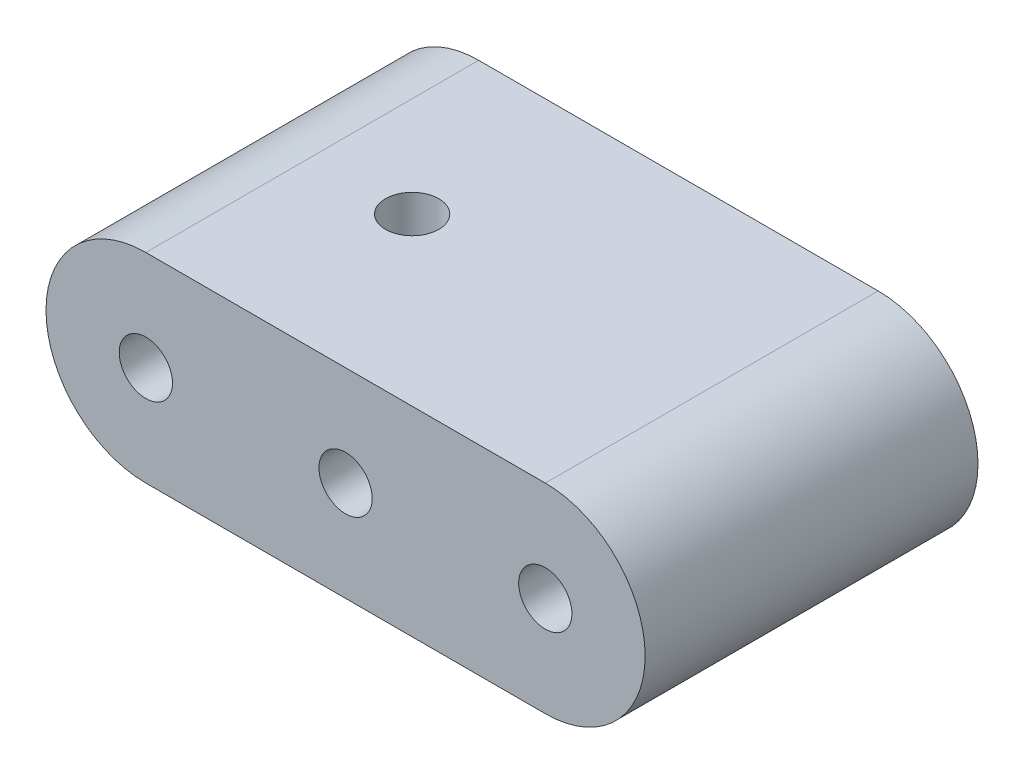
ISO-10303-21;
HEADER;
FILE_DESCRIPTION(('STEP AP214'),'2;1');
FILE_NAME('part.step','',(''),(''),'','','');
FILE_SCHEMA(('AUTOMOTIVE_DESIGN { 1 0 10303 214 1 1 1 1 }'));
ENDSEC;
DATA;
#1=APPLICATION_CONTEXT('core data for automotive mechanical design processes');
#2=APPLICATION_PROTOCOL_DEFINITION('international standard','automotive_design',2000,#1);
#3=PRODUCT_CONTEXT('',#1,'mechanical');
#4=PRODUCT('Part','Part','',(#3));
#5=PRODUCT_RELATED_PRODUCT_CATEGORY('part','',(#4));
#6=PRODUCT_DEFINITION_FORMATION('','',#4);
#7=PRODUCT_DEFINITION_CONTEXT('part definition',#1,'design');
#8=PRODUCT_DEFINITION('design','',#6,#7);
#9=PRODUCT_DEFINITION_SHAPE('','',#8);
#10=(LENGTH_UNIT() NAMED_UNIT(*) SI_UNIT(.MILLI.,.METRE.));
#11=(NAMED_UNIT(*) PLANE_ANGLE_UNIT() SI_UNIT($,.RADIAN.));
#12=(NAMED_UNIT(*) SI_UNIT($,.STERADIAN.) SOLID_ANGLE_UNIT());
#13=UNCERTAINTY_MEASURE_WITH_UNIT(LENGTH_MEASURE(1.E-05),#10,'distance_accuracy_value','');
#14=(GEOMETRIC_REPRESENTATION_CONTEXT(3) GLOBAL_UNCERTAINTY_ASSIGNED_CONTEXT((#13)) GLOBAL_UNIT_ASSIGNED_CONTEXT((#10,
#11,#12)) REPRESENTATION_CONTEXT('',''));
#15=CARTESIAN_POINT('',(0.,0.,0.));
#16=DIRECTION('',(0.,0.,1.));
#17=DIRECTION('',(1.,0.,0.));
#18=AXIS2_PLACEMENT_3D('',#15,#16,#17);
#19=CARTESIAN_POINT('',(-30.,0.,50.));
#20=DIRECTION('',(0.,0.,-1.));
#21=DIRECTION('',(-1.,0.,0.));
#22=AXIS2_PLACEMENT_3D('',#19,#20,#21);
#23=CYLINDRICAL_SURFACE('',#22,15.);
#24=CARTESIAN_POINT('',(-30.,0.,0.));
#25=DIRECTION('',(0.,0.,1.));
#26=DIRECTION('',(1.,0.,0.));
#27=AXIS2_PLACEMENT_3D('',#24,#25,#26);
#28=CIRCLE('',#27,15.);
#29=CARTESIAN_POINT('',(-30.,15.,0.));
#30=VERTEX_POINT('',#29);
#31=CARTESIAN_POINT('',(-30.,-15.,0.));
#32=VERTEX_POINT('',#31);
#33=EDGE_CURVE('E207',#30,#32,#28,.T.);
#34=ORIENTED_EDGE('',*,*,#33,.T.);
#35=DIRECTION('',(0.,0.,-1.));
#36=VECTOR('',#35,1.);
#37=CARTESIAN_POINT('',(-30.,-15.,50.));
#38=LINE('',#37,#36);
#39=CARTESIAN_POINT('',(-30.,-15.,50.));
#40=VERTEX_POINT('',#39);
#41=EDGE_CURVE('E11',#40,#32,#38,.T.);
#42=ORIENTED_EDGE('',*,*,#41,.F.);
#43=CARTESIAN_POINT('',(-30.,0.,50.));
#44=DIRECTION('',(0.,0.,1.));
#45=DIRECTION('',(1.,0.,0.));
#46=AXIS2_PLACEMENT_3D('',#43,#44,#45);
#47=CIRCLE('',#46,15.);
#48=CARTESIAN_POINT('',(-30.,15.,50.));
#49=VERTEX_POINT('',#48);
#50=EDGE_CURVE('E227',#49,#40,#47,.T.);
#51=ORIENTED_EDGE('',*,*,#50,.F.);
#52=DIRECTION('',(0.,0.,-1.));
#53=VECTOR('',#52,1.);
#54=CARTESIAN_POINT('',(-30.,15.,50.));
#55=LINE('',#54,#53);
#56=EDGE_CURVE('E237',#49,#30,#55,.T.);
#57=ORIENTED_EDGE('',*,*,#56,.T.);
#58=EDGE_LOOP('',(#34,#42,#51,#57));
#59=FACE_BOUND('',#58,.T.);
#60=ADVANCED_FACE('F41',(#59),#23,.T.);
#61=CARTESIAN_POINT('',(-30.,-15.,50.));
#62=DIRECTION('',(0.,1.,0.));
#63=DIRECTION('',(-1.,0.,0.));
#64=AXIS2_PLACEMENT_3D('',#61,#62,#63);
#65=PLANE('',#64);
#66=DIRECTION('',(1.,0.,0.));
#67=VECTOR('',#66,1.);
#68=CARTESIAN_POINT('',(-30.,-15.,0.));
#69=LINE('',#68,#67);
#70=CARTESIAN_POINT('',(30.,-15.,0.));
#71=VERTEX_POINT('',#70);
#72=EDGE_CURVE('E241',#32,#71,#69,.T.);
#73=ORIENTED_EDGE('',*,*,#72,.T.);
#74=DIRECTION('',(0.,0.,-1.));
#75=VECTOR('',#74,1.);
#76=CARTESIAN_POINT('',(30.,-15.,50.));
#77=LINE('',#76,#75);
#78=CARTESIAN_POINT('',(30.,-15.,50.));
#79=VERTEX_POINT('',#78);
#80=EDGE_CURVE('E50',#79,#71,#77,.T.);
#81=ORIENTED_EDGE('',*,*,#80,.F.);
#82=DIRECTION('',(1.,0.,0.));
#83=VECTOR('',#82,1.);
#84=CARTESIAN_POINT('',(-30.,-15.,50.));
#85=LINE('',#84,#83);
#86=EDGE_CURVE('E89',#40,#79,#85,.T.);
#87=ORIENTED_EDGE('',*,*,#86,.F.);
#88=ORIENTED_EDGE('',*,*,#41,.T.);
#89=EDGE_LOOP('',(#73,#81,#87,#88));
#90=FACE_BOUND('',#89,.T.);
#91=ADVANCED_FACE('F272',(#90),#65,.F.);
#92=CARTESIAN_POINT('',(30.,0.,50.));
#93=DIRECTION('',(0.,0.,-1.));
#94=DIRECTION('',(-1.,0.,0.));
#95=AXIS2_PLACEMENT_3D('',#92,#93,#94);
#96=CYLINDRICAL_SURFACE('',#95,15.);
#97=CARTESIAN_POINT('',(30.,0.,0.));
#98=DIRECTION('',(0.,0.,1.));
#99=DIRECTION('',(1.,0.,0.));
#100=AXIS2_PLACEMENT_3D('',#97,#98,#99);
#101=CIRCLE('',#100,15.);
#102=CARTESIAN_POINT('',(30.,15.,0.));
#103=VERTEX_POINT('',#102);
#104=EDGE_CURVE('E76',#71,#103,#101,.T.);
#105=ORIENTED_EDGE('',*,*,#104,.T.);
#106=DIRECTION('',(0.,0.,-1.));
#107=VECTOR('',#106,1.);
#108=CARTESIAN_POINT('',(30.,15.,50.));
#109=LINE('',#108,#107);
#110=CARTESIAN_POINT('',(30.,15.,50.));
#111=VERTEX_POINT('',#110);
#112=EDGE_CURVE('E250',#111,#103,#109,.T.);
#113=ORIENTED_EDGE('',*,*,#112,.F.);
#114=CARTESIAN_POINT('',(30.,0.,50.));
#115=DIRECTION('',(0.,0.,1.));
#116=DIRECTION('',(1.,0.,0.));
#117=AXIS2_PLACEMENT_3D('',#114,#115,#116);
#118=CIRCLE('',#117,15.);
#119=EDGE_CURVE('E232',#79,#111,#118,.T.);
#120=ORIENTED_EDGE('',*,*,#119,.F.);
#121=ORIENTED_EDGE('',*,*,#80,.T.);
#122=EDGE_LOOP('',(#105,#113,#120,#121));
#123=FACE_BOUND('',#122,.T.);
#124=ADVANCED_FACE('F254',(#123),#96,.T.);
#125=CARTESIAN_POINT('',(-30.,15.,50.));
#126=DIRECTION('',(0.,-1.,0.));
#127=DIRECTION('',(1.,0.,0.));
#128=AXIS2_PLACEMENT_3D('',#125,#126,#127);
#129=PLANE('',#128);
#130=CARTESIAN_POINT('',(-15.,15.,25.));
#131=DIRECTION('',(0.,1.,0.));
#132=DIRECTION('',(-1.,0.,0.));
#133=AXIS2_PLACEMENT_3D('',#130,#131,#132);
#134=CIRCLE('',#133,4.);
#135=CARTESIAN_POINT('',(-19.,15.,25.));
#136=VERTEX_POINT('',#135);
#137=EDGE_CURVE('E165',#136,#136,#134,.T.);
#138=ORIENTED_EDGE('',*,*,#137,.F.);
#139=EDGE_LOOP('',(#138));
#140=FACE_BOUND('',#139,.T.);
#141=DIRECTION('',(-1.,0.,0.));
#142=VECTOR('',#141,1.);
#143=CARTESIAN_POINT('',(-30.,15.,0.));
#144=LINE('',#143,#142);
#145=EDGE_CURVE('E82',#103,#30,#144,.T.);
#146=ORIENTED_EDGE('',*,*,#145,.T.);
#147=ORIENTED_EDGE('',*,*,#56,.F.);
#148=DIRECTION('',(-1.,0.,0.));
#149=VECTOR('',#148,1.);
#150=CARTESIAN_POINT('',(-30.,15.,50.));
#151=LINE('',#150,#149);
#152=EDGE_CURVE('E58',#111,#49,#151,.T.);
#153=ORIENTED_EDGE('',*,*,#152,.F.);
#154=ORIENTED_EDGE('',*,*,#112,.T.);
#155=EDGE_LOOP('',(#146,#147,#153,#154));
#156=FACE_BOUND('',#155,.T.);
#157=ADVANCED_FACE('F261',(#140,#156),#129,.F.);
#158=CARTESIAN_POINT('',(-30.,0.,50.));
#159=DIRECTION('',(0.,0.,1.));
#160=DIRECTION('',(1.,0.,0.));
#161=AXIS2_PLACEMENT_3D('',#158,#159,#160);
#162=PLANE('',#161);
#163=CARTESIAN_POINT('',(-30.,0.,50.));
#164=DIRECTION('',(0.,0.,1.));
#165=DIRECTION('',(1.,0.,0.));
#166=AXIS2_PLACEMENT_3D('',#163,#164,#165);
#167=CIRCLE('',#166,4.);
#168=CARTESIAN_POINT('',(-26.,0.,50.));
#169=VERTEX_POINT('',#168);
#170=EDGE_CURVE('E208',#169,#169,#167,.T.);
#171=ORIENTED_EDGE('',*,*,#170,.F.);
#172=EDGE_LOOP('',(#171));
#173=FACE_BOUND('',#172,.T.);
#174=CARTESIAN_POINT('',(0.,0.,50.));
#175=DIRECTION('',(0.,0.,1.));
#176=DIRECTION('',(1.,0.,0.));
#177=AXIS2_PLACEMENT_3D('',#174,#175,#176);
#178=CIRCLE('',#177,4.);
#179=CARTESIAN_POINT('',(4.,0.,50.));
#180=VERTEX_POINT('',#179);
#181=EDGE_CURVE('E216',#180,#180,#178,.T.);
#182=ORIENTED_EDGE('',*,*,#181,.F.);
#183=EDGE_LOOP('',(#182));
#184=FACE_BOUND('',#183,.T.);
#185=CARTESIAN_POINT('',(30.,0.,50.));
#186=DIRECTION('',(0.,0.,1.));
#187=DIRECTION('',(1.,0.,0.));
#188=AXIS2_PLACEMENT_3D('',#185,#186,#187);
#189=CIRCLE('',#188,4.);
#190=CARTESIAN_POINT('',(34.,0.,50.));
#191=VERTEX_POINT('',#190);
#192=EDGE_CURVE('E183',#191,#191,#189,.T.);
#193=ORIENTED_EDGE('',*,*,#192,.F.);
#194=EDGE_LOOP('',(#193));
#195=FACE_BOUND('',#194,.T.);
#196=ORIENTED_EDGE('',*,*,#50,.T.);
#197=ORIENTED_EDGE('',*,*,#86,.T.);
#198=ORIENTED_EDGE('',*,*,#119,.T.);
#199=ORIENTED_EDGE('',*,*,#152,.T.);
#200=EDGE_LOOP('',(#196,#197,#198,#199));
#201=FACE_BOUND('',#200,.T.);
#202=ADVANCED_FACE('F263',(#173,#184,#195,#201),#162,.T.);
#203=CARTESIAN_POINT('',(-30.,0.,0.));
#204=DIRECTION('',(0.,0.,1.));
#205=DIRECTION('',(1.,0.,0.));
#206=AXIS2_PLACEMENT_3D('',#203,#204,#205);
#207=PLANE('',#206);
#208=CARTESIAN_POINT('',(30.,0.,0.));
#209=DIRECTION('',(0.,0.,-1.));
#210=DIRECTION('',(-1.,0.,0.));
#211=AXIS2_PLACEMENT_3D('',#208,#209,#210);
#212=CIRCLE('',#211,4.);
#213=CARTESIAN_POINT('',(26.,0.,0.));
#214=VERTEX_POINT('',#213);
#215=EDGE_CURVE('E184',#214,#214,#212,.T.);
#216=ORIENTED_EDGE('',*,*,#215,.F.);
#217=EDGE_LOOP('',(#216));
#218=FACE_BOUND('',#217,.T.);
#219=CARTESIAN_POINT('',(0.,0.,0.));
#220=DIRECTION('',(0.,0.,-1.));
#221=DIRECTION('',(-1.,0.,0.));
#222=AXIS2_PLACEMENT_3D('',#219,#220,#221);
#223=CIRCLE('',#222,4.);
#224=CARTESIAN_POINT('',(-4.,0.,0.));
#225=VERTEX_POINT('',#224);
#226=EDGE_CURVE('E192',#225,#225,#223,.T.);
#227=ORIENTED_EDGE('',*,*,#226,.F.);
#228=EDGE_LOOP('',(#227));
#229=FACE_BOUND('',#228,.T.);
#230=CARTESIAN_POINT('',(-30.,0.,0.));
#231=DIRECTION('',(0.,0.,-1.));
#232=DIRECTION('',(-1.,0.,0.));
#233=AXIS2_PLACEMENT_3D('',#230,#231,#232);
#234=CIRCLE('',#233,4.);
#235=CARTESIAN_POINT('',(-34.,0.,0.));
#236=VERTEX_POINT('',#235);
#237=EDGE_CURVE('E175',#236,#236,#234,.T.);
#238=ORIENTED_EDGE('',*,*,#237,.F.);
#239=EDGE_LOOP('',(#238));
#240=FACE_BOUND('',#239,.T.);
#241=ORIENTED_EDGE('',*,*,#33,.F.);
#242=ORIENTED_EDGE('',*,*,#145,.F.);
#243=ORIENTED_EDGE('',*,*,#104,.F.);
#244=ORIENTED_EDGE('',*,*,#72,.F.);
#245=EDGE_LOOP('',(#241,#242,#243,#244));
#246=FACE_BOUND('',#245,.T.);
#247=ADVANCED_FACE('F257',(#218,#229,#240,#246),#207,.F.);
#248=CARTESIAN_POINT('',(30.,0.,44.));
#249=DIRECTION('',(0.,0.,1.));
#250=DIRECTION('',(1.,0.,0.));
#251=AXIS2_PLACEMENT_3D('',#248,#249,#250);
#252=CYLINDRICAL_SURFACE('',#251,4.);
#253=CARTESIAN_POINT('',(30.,0.,44.));
#254=DIRECTION('',(0.,0.,1.));
#255=DIRECTION('',(1.,0.,0.));
#256=AXIS2_PLACEMENT_3D('',#253,#254,#255);
#257=CIRCLE('',#256,4.);
#258=CARTESIAN_POINT('',(34.,0.,44.));
#259=VERTEX_POINT('',#258);
#260=EDGE_CURVE('E220',#259,#259,#257,.T.);
#261=ORIENTED_EDGE('',*,*,#260,.F.);
#262=EDGE_LOOP('',(#261));
#263=FACE_BOUND('',#262,.T.);
#264=ORIENTED_EDGE('',*,*,#192,.T.);
#265=EDGE_LOOP('',(#264));
#266=FACE_BOUND('',#265,.T.);
#267=ADVANCED_FACE('F300',(#263,#266),#252,.F.);
#268=CARTESIAN_POINT('',(30.,0.,44.));
#269=DIRECTION('',(0.,0.,1.));
#270=DIRECTION('',(1.,0.,0.));
#271=AXIS2_PLACEMENT_3D('',#268,#269,#270);
#272=PLANE('',#271);
#273=ORIENTED_EDGE('',*,*,#260,.T.);
#274=EDGE_LOOP('',(#273));
#275=FACE_BOUND('',#274,.T.);
#276=ADVANCED_FACE('F305',(#275),#272,.T.);
#277=CARTESIAN_POINT('',(0.,0.,44.));
#278=DIRECTION('',(0.,0.,1.));
#279=DIRECTION('',(1.,0.,0.));
#280=AXIS2_PLACEMENT_3D('',#277,#278,#279);
#281=CYLINDRICAL_SURFACE('',#280,4.);
#282=CARTESIAN_POINT('',(0.,0.,44.));
#283=DIRECTION('',(0.,0.,1.));
#284=DIRECTION('',(1.,0.,0.));
#285=AXIS2_PLACEMENT_3D('',#282,#283,#284);
#286=CIRCLE('',#285,4.);
#287=CARTESIAN_POINT('',(4.,0.,44.));
#288=VERTEX_POINT('',#287);
#289=EDGE_CURVE('E212',#288,#288,#286,.T.);
#290=ORIENTED_EDGE('',*,*,#289,.F.);
#291=EDGE_LOOP('',(#290));
#292=FACE_BOUND('',#291,.T.);
#293=ORIENTED_EDGE('',*,*,#181,.T.);
#294=EDGE_LOOP('',(#293));
#295=FACE_BOUND('',#294,.T.);
#296=ADVANCED_FACE('F315',(#292,#295),#281,.F.);
#297=CARTESIAN_POINT('',(0.,0.,44.));
#298=DIRECTION('',(0.,0.,1.));
#299=DIRECTION('',(1.,0.,0.));
#300=AXIS2_PLACEMENT_3D('',#297,#298,#299);
#301=PLANE('',#300);
#302=ORIENTED_EDGE('',*,*,#289,.T.);
#303=EDGE_LOOP('',(#302));
#304=FACE_BOUND('',#303,.T.);
#305=ADVANCED_FACE('F325',(#304),#301,.T.);
#306=CARTESIAN_POINT('',(-30.,0.,44.));
#307=DIRECTION('',(0.,0.,1.));
#308=DIRECTION('',(1.,0.,0.));
#309=AXIS2_PLACEMENT_3D('',#306,#307,#308);
#310=CYLINDRICAL_SURFACE('',#309,4.);
#311=CARTESIAN_POINT('',(-30.,0.,44.));
#312=DIRECTION('',(0.,0.,1.));
#313=DIRECTION('',(1.,0.,0.));
#314=AXIS2_PLACEMENT_3D('',#311,#312,#313);
#315=CIRCLE('',#314,4.);
#316=CARTESIAN_POINT('',(-26.,0.,44.));
#317=VERTEX_POINT('',#316);
#318=EDGE_CURVE('E203',#317,#317,#315,.T.);
#319=ORIENTED_EDGE('',*,*,#318,.F.);
#320=EDGE_LOOP('',(#319));
#321=FACE_BOUND('',#320,.T.);
#322=ORIENTED_EDGE('',*,*,#170,.T.);
#323=EDGE_LOOP('',(#322));
#324=FACE_BOUND('',#323,.T.);
#325=ADVANCED_FACE('F335',(#321,#324),#310,.F.);
#326=CARTESIAN_POINT('',(-30.,0.,44.));
#327=DIRECTION('',(0.,0.,1.));
#328=DIRECTION('',(1.,0.,0.));
#329=AXIS2_PLACEMENT_3D('',#326,#327,#328);
#330=PLANE('',#329);
#331=ORIENTED_EDGE('',*,*,#318,.T.);
#332=EDGE_LOOP('',(#331));
#333=FACE_BOUND('',#332,.T.);
#334=ADVANCED_FACE('F345',(#333),#330,.T.);
#335=CARTESIAN_POINT('',(-30.,0.,6.));
#336=DIRECTION('',(0.,0.,-1.));
#337=DIRECTION('',(-1.,0.,0.));
#338=AXIS2_PLACEMENT_3D('',#335,#336,#337);
#339=CYLINDRICAL_SURFACE('',#338,4.);
#340=CARTESIAN_POINT('',(-30.,0.,6.));
#341=DIRECTION('',(0.,0.,-1.));
#342=DIRECTION('',(-1.,0.,0.));
#343=AXIS2_PLACEMENT_3D('',#340,#341,#342);
#344=CIRCLE('',#343,4.);
#345=CARTESIAN_POINT('',(-34.,0.,6.));
#346=VERTEX_POINT('',#345);
#347=EDGE_CURVE('E196',#346,#346,#344,.T.);
#348=ORIENTED_EDGE('',*,*,#347,.F.);
#349=EDGE_LOOP('',(#348));
#350=FACE_BOUND('',#349,.T.);
#351=ORIENTED_EDGE('',*,*,#237,.T.);
#352=EDGE_LOOP('',(#351));
#353=FACE_BOUND('',#352,.T.);
#354=ADVANCED_FACE('F355',(#350,#353),#339,.F.);
#355=CARTESIAN_POINT('',(-30.,0.,6.));
#356=DIRECTION('',(0.,0.,-1.));
#357=DIRECTION('',(-1.,0.,0.));
#358=AXIS2_PLACEMENT_3D('',#355,#356,#357);
#359=PLANE('',#358);
#360=ORIENTED_EDGE('',*,*,#347,.T.);
#361=EDGE_LOOP('',(#360));
#362=FACE_BOUND('',#361,.T.);
#363=ADVANCED_FACE('F371',(#362),#359,.T.);
#364=CARTESIAN_POINT('',(0.,0.,6.));
#365=DIRECTION('',(0.,0.,-1.));
#366=DIRECTION('',(-1.,0.,0.));
#367=AXIS2_PLACEMENT_3D('',#364,#365,#366);
#368=CYLINDRICAL_SURFACE('',#367,4.);
#369=CARTESIAN_POINT('',(0.,0.,6.));
#370=DIRECTION('',(0.,0.,-1.));
#371=DIRECTION('',(-1.,0.,0.));
#372=AXIS2_PLACEMENT_3D('',#369,#370,#371);
#373=CIRCLE('',#372,4.);
#374=CARTESIAN_POINT('',(-4.,0.,6.));
#375=VERTEX_POINT('',#374);
#376=EDGE_CURVE('E188',#375,#375,#373,.T.);
#377=ORIENTED_EDGE('',*,*,#376,.F.);
#378=EDGE_LOOP('',(#377));
#379=FACE_BOUND('',#378,.T.);
#380=ORIENTED_EDGE('',*,*,#226,.T.);
#381=EDGE_LOOP('',(#380));
#382=FACE_BOUND('',#381,.T.);
#383=ADVANCED_FACE('F381',(#379,#382),#368,.F.);
#384=CARTESIAN_POINT('',(0.,0.,6.));
#385=DIRECTION('',(0.,0.,-1.));
#386=DIRECTION('',(-1.,0.,0.));
#387=AXIS2_PLACEMENT_3D('',#384,#385,#386);
#388=PLANE('',#387);
#389=ORIENTED_EDGE('',*,*,#376,.T.);
#390=EDGE_LOOP('',(#389));
#391=FACE_BOUND('',#390,.T.);
#392=ADVANCED_FACE('F391',(#391),#388,.T.);
#393=CARTESIAN_POINT('',(30.,0.,6.));
#394=DIRECTION('',(0.,0.,-1.));
#395=DIRECTION('',(-1.,0.,0.));
#396=AXIS2_PLACEMENT_3D('',#393,#394,#395);
#397=CYLINDRICAL_SURFACE('',#396,4.);
#398=CARTESIAN_POINT('',(30.,0.,6.));
#399=DIRECTION('',(0.,0.,-1.));
#400=DIRECTION('',(-1.,0.,0.));
#401=AXIS2_PLACEMENT_3D('',#398,#399,#400);
#402=CIRCLE('',#401,4.);
#403=CARTESIAN_POINT('',(26.,0.,6.));
#404=VERTEX_POINT('',#403);
#405=EDGE_CURVE('E179',#404,#404,#402,.T.);
#406=ORIENTED_EDGE('',*,*,#405,.F.);
#407=EDGE_LOOP('',(#406));
#408=FACE_BOUND('',#407,.T.);
#409=ORIENTED_EDGE('',*,*,#215,.T.);
#410=EDGE_LOOP('',(#409));
#411=FACE_BOUND('',#410,.T.);
#412=ADVANCED_FACE('F401',(#408,#411),#397,.F.);
#413=CARTESIAN_POINT('',(30.,0.,6.));
#414=DIRECTION('',(0.,0.,-1.));
#415=DIRECTION('',(-1.,0.,0.));
#416=AXIS2_PLACEMENT_3D('',#413,#414,#415);
#417=PLANE('',#416);
#418=ORIENTED_EDGE('',*,*,#405,.T.);
#419=EDGE_LOOP('',(#418));
#420=FACE_BOUND('',#419,.T.);
#421=ADVANCED_FACE('F411',(#420),#417,.T.);
#422=CARTESIAN_POINT('',(-15.,9.,25.));
#423=DIRECTION('',(0.,1.,0.));
#424=DIRECTION('',(-1.,0.,0.));
#425=AXIS2_PLACEMENT_3D('',#422,#423,#424);
#426=CYLINDRICAL_SURFACE('',#425,4.);
#427=CARTESIAN_POINT('',(-15.,9.,25.));
#428=DIRECTION('',(0.,1.,0.));
#429=DIRECTION('',(-1.,0.,0.));
#430=AXIS2_PLACEMENT_3D('',#427,#428,#429);
#431=CIRCLE('',#430,4.);
#432=CARTESIAN_POINT('',(-19.,9.,25.));
#433=VERTEX_POINT('',#432);
#434=EDGE_CURVE('E171',#433,#433,#431,.T.);
#435=ORIENTED_EDGE('',*,*,#434,.F.);
#436=EDGE_LOOP('',(#435));
#437=FACE_BOUND('',#436,.T.);
#438=ORIENTED_EDGE('',*,*,#137,.T.);
#439=EDGE_LOOP('',(#438));
#440=FACE_BOUND('',#439,.T.);
#441=ADVANCED_FACE('F420',(#437,#440),#426,.F.);
#442=CARTESIAN_POINT('',(-15.,9.,25.));
#443=DIRECTION('',(0.,1.,0.));
#444=DIRECTION('',(-1.,0.,0.));
#445=AXIS2_PLACEMENT_3D('',#442,#443,#444);
#446=PLANE('',#445);
#447=ORIENTED_EDGE('',*,*,#434,.T.);
#448=EDGE_LOOP('',(#447));
#449=FACE_BOUND('',#448,.T.);
#450=ADVANCED_FACE('F434',(#449),#446,.T.);
#451=CLOSED_SHELL('',(#60,#91,#124,#157,#202,#247,#267,#276,#296,#305,#325,#334,#354,#363,#383,
#392,#412,#421,#441,#450));
#452=CARTESIAN_POINT('',(-30.,0.,40.));
#453=DIRECTION('',(0.,0.,-1.));
#454=DIRECTION('',(-1.,0.,0.));
#455=AXIS2_PLACEMENT_3D('',#452,#453,#454);
#456=CYLINDRICAL_SURFACE('',#455,10.);
#457=CARTESIAN_POINT('',(-30.,0.,10.));
#458=DIRECTION('',(0.,0.,-1.));
#459=DIRECTION('',(-1.,0.,0.));
#460=AXIS2_PLACEMENT_3D('',#457,#458,#459);
#461=CIRCLE('',#460,10.);
#462=CARTESIAN_POINT('',(-21.3397459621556,-5.,10.));
#463=VERTEX_POINT('',#462);
#464=CARTESIAN_POINT('',(-21.3397459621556,5.00000000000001,10.));
#465=VERTEX_POINT('',#464);
#466=EDGE_CURVE('E123',#463,#465,#461,.T.);
#467=ORIENTED_EDGE('',*,*,#466,.T.);
#468=DIRECTION('',(0.,0.,-1.));
#469=VECTOR('',#468,1.);
#470=CARTESIAN_POINT('',(-21.3397459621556,5.00000000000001,40.));
#471=LINE('',#470,#469);
#472=CARTESIAN_POINT('',(-21.3397459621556,5.00000000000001,40.));
#473=VERTEX_POINT('',#472);
#474=EDGE_CURVE('E116',#473,#465,#471,.T.);
#475=ORIENTED_EDGE('',*,*,#474,.F.);
#476=CARTESIAN_POINT('',(-30.,0.,40.));
#477=DIRECTION('',(0.,0.,-1.));
#478=DIRECTION('',(-1.,0.,0.));
#479=AXIS2_PLACEMENT_3D('',#476,#477,#478);
#480=CIRCLE('',#479,10.);
#481=CARTESIAN_POINT('',(-21.3397459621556,-5.,40.));
#482=VERTEX_POINT('',#481);
#483=EDGE_CURVE('E120',#482,#473,#480,.T.);
#484=ORIENTED_EDGE('',*,*,#483,.F.);
#485=DIRECTION('',(0.,0.,-1.));
#486=VECTOR('',#485,1.);
#487=CARTESIAN_POINT('',(-21.3397459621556,-5.,40.));
#488=LINE('',#487,#486);
#489=EDGE_CURVE('E162',#482,#463,#488,.T.);
#490=ORIENTED_EDGE('',*,*,#489,.T.);
#491=EDGE_LOOP('',(#467,#475,#484,#490));
#492=FACE_BOUND('',#491,.T.);
#493=ADVANCED_FACE('F118',(#492),#456,.F.);
#494=CARTESIAN_POINT('',(21.3397459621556,-5.,40.));
#495=DIRECTION('',(0.,-1.,0.));
#496=DIRECTION('',(0.,0.,-1.));
#497=AXIS2_PLACEMENT_3D('',#494,#495,#496);
#498=PLANE('',#497);
#499=DIRECTION('',(-1.,0.,0.));
#500=VECTOR('',#499,1.);
#501=CARTESIAN_POINT('',(21.3397459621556,-5.,10.));
#502=LINE('',#501,#500);
#503=CARTESIAN_POINT('',(21.3397459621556,-5.,10.));
#504=VERTEX_POINT('',#503);
#505=EDGE_CURVE('E143',#504,#463,#502,.T.);
#506=ORIENTED_EDGE('',*,*,#505,.T.);
#507=ORIENTED_EDGE('',*,*,#489,.F.);
#508=DIRECTION('',(-1.,0.,0.));
#509=VECTOR('',#508,1.);
#510=CARTESIAN_POINT('',(21.3397459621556,-5.,40.));
#511=LINE('',#510,#509);
#512=CARTESIAN_POINT('',(21.3397459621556,-5.,40.));
#513=VERTEX_POINT('',#512);
#514=EDGE_CURVE('E129',#513,#482,#511,.T.);
#515=ORIENTED_EDGE('',*,*,#514,.F.);
#516=DIRECTION('',(0.,0.,-1.));
#517=VECTOR('',#516,1.);
#518=CARTESIAN_POINT('',(21.3397459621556,-5.,40.));
#519=LINE('',#518,#517);
#520=EDGE_CURVE('E166',#513,#504,#519,.T.);
#521=ORIENTED_EDGE('',*,*,#520,.T.);
#522=EDGE_LOOP('',(#506,#507,#515,#521));
#523=FACE_BOUND('',#522,.T.);
#524=ADVANCED_FACE('F453',(#523),#498,.F.);
#525=CARTESIAN_POINT('',(30.,0.,40.));
#526=DIRECTION('',(0.,0.,-1.));
#527=DIRECTION('',(-1.,0.,0.));
#528=AXIS2_PLACEMENT_3D('',#525,#526,#527);
#529=CYLINDRICAL_SURFACE('',#528,10.);
#530=CARTESIAN_POINT('',(30.,0.,10.));
#531=DIRECTION('',(0.,0.,-1.));
#532=DIRECTION('',(-1.,0.,0.));
#533=AXIS2_PLACEMENT_3D('',#530,#531,#532);
#534=CIRCLE('',#533,10.);
#535=CARTESIAN_POINT('',(21.3397459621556,5.00000000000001,10.));
#536=VERTEX_POINT('',#535);
#537=EDGE_CURVE('E147',#536,#504,#534,.T.);
#538=ORIENTED_EDGE('',*,*,#537,.T.);
#539=ORIENTED_EDGE('',*,*,#520,.F.);
#540=CARTESIAN_POINT('',(30.,0.,40.));
#541=DIRECTION('',(0.,0.,-1.));
#542=DIRECTION('',(-1.,0.,0.));
#543=AXIS2_PLACEMENT_3D('',#540,#541,#542);
#544=CIRCLE('',#543,10.);
#545=CARTESIAN_POINT('',(21.3397459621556,5.00000000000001,40.));
#546=VERTEX_POINT('',#545);
#547=EDGE_CURVE('E138',#546,#513,#544,.T.);
#548=ORIENTED_EDGE('',*,*,#547,.F.);
#549=DIRECTION('',(0.,0.,-1.));
#550=VECTOR('',#549,1.);
#551=CARTESIAN_POINT('',(21.3397459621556,5.00000000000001,40.));
#552=LINE('',#551,#550);
#553=EDGE_CURVE('E128',#546,#536,#552,.T.);
#554=ORIENTED_EDGE('',*,*,#553,.T.);
#555=EDGE_LOOP('',(#538,#539,#548,#554));
#556=FACE_BOUND('',#555,.T.);
#557=ADVANCED_FACE('F463',(#556),#529,.F.);
#558=CARTESIAN_POINT('',(21.3397459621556,5.00000000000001,40.));
#559=DIRECTION('',(0.,1.,0.));
#560=DIRECTION('',(0.,0.,1.));
#561=AXIS2_PLACEMENT_3D('',#558,#559,#560);
#562=PLANE('',#561);
#563=DIRECTION('',(1.,0.,0.));
#564=VECTOR('',#563,1.);
#565=CARTESIAN_POINT('',(21.3397459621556,5.00000000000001,10.));
#566=LINE('',#565,#564);
#567=EDGE_CURVE('E156',#465,#536,#566,.T.);
#568=ORIENTED_EDGE('',*,*,#567,.T.);
#569=ORIENTED_EDGE('',*,*,#553,.F.);
#570=DIRECTION('',(1.,0.,0.));
#571=VECTOR('',#570,1.);
#572=CARTESIAN_POINT('',(21.3397459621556,5.00000000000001,40.));
#573=LINE('',#572,#571);
#574=EDGE_CURVE('E132',#473,#546,#573,.T.);
#575=ORIENTED_EDGE('',*,*,#574,.F.);
#576=ORIENTED_EDGE('',*,*,#474,.T.);
#577=EDGE_LOOP('',(#568,#569,#575,#576));
#578=FACE_BOUND('',#577,.T.);
#579=ADVANCED_FACE('F133',(#578),#562,.F.);
#580=CARTESIAN_POINT('',(-30.,0.,40.));
#581=DIRECTION('',(0.,0.,-1.));
#582=DIRECTION('',(-1.,0.,0.));
#583=AXIS2_PLACEMENT_3D('',#580,#581,#582);
#584=PLANE('',#583);
#585=ORIENTED_EDGE('',*,*,#483,.T.);
#586=ORIENTED_EDGE('',*,*,#574,.T.);
#587=ORIENTED_EDGE('',*,*,#547,.T.);
#588=ORIENTED_EDGE('',*,*,#514,.T.);
#589=EDGE_LOOP('',(#585,#586,#587,#588));
#590=FACE_BOUND('',#589,.T.);
#591=ADVANCED_FACE('F140',(#590),#584,.T.);
#592=CARTESIAN_POINT('',(-30.,0.,10.));
#593=DIRECTION('',(0.,0.,-1.));
#594=DIRECTION('',(-1.,0.,0.));
#595=AXIS2_PLACEMENT_3D('',#592,#593,#594);
#596=PLANE('',#595);
#597=ORIENTED_EDGE('',*,*,#466,.F.);
#598=ORIENTED_EDGE('',*,*,#505,.F.);
#599=ORIENTED_EDGE('',*,*,#537,.F.);
#600=ORIENTED_EDGE('',*,*,#567,.F.);
#601=EDGE_LOOP('',(#597,#598,#599,#600));
#602=FACE_BOUND('',#601,.T.);
#603=ADVANCED_FACE('F490',(#602),#596,.F.);
#604=CLOSED_SHELL('',(#493,#524,#557,#579,#591,#603));
#605=ORIENTED_CLOSED_SHELL('',*,#604,.T.);
#606=BREP_WITH_VOIDS('B2',#451,(#605));
#607=ADVANCED_BREP_SHAPE_REPRESENTATION('',(#18,#606),#14);
#608=SHAPE_DEFINITION_REPRESENTATION(#9,#607);
ENDSEC;
END-ISO-10303-21;
